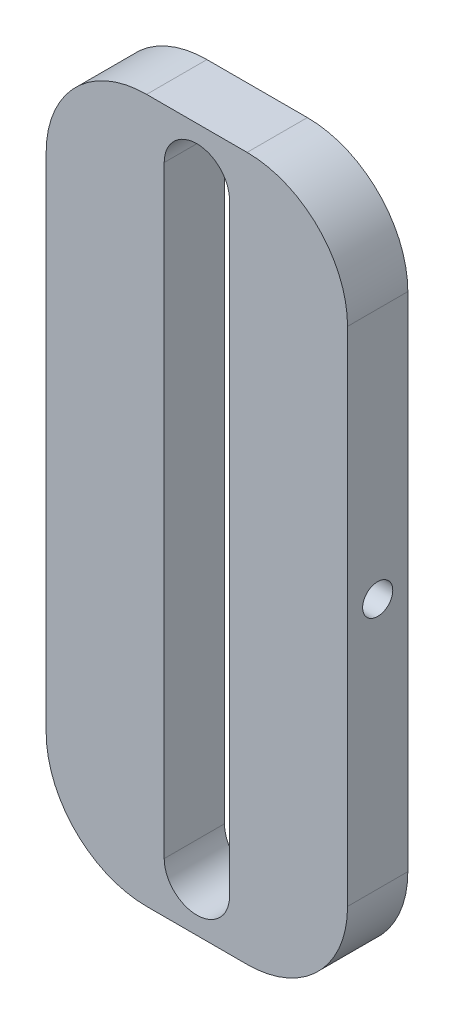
ISO-10303-21;
HEADER;
FILE_DESCRIPTION(('STEP AP214'),'2;1');
FILE_NAME('part.step','',(''),(''),'','','');
FILE_SCHEMA(('AUTOMOTIVE_DESIGN { 1 0 10303 214 1 1 1 1 }'));
ENDSEC;
DATA;
#1=APPLICATION_CONTEXT('core data for automotive mechanical design processes');
#2=APPLICATION_PROTOCOL_DEFINITION('international standard','automotive_design',2000,#1);
#3=PRODUCT_CONTEXT('',#1,'mechanical');
#4=PRODUCT('Part','Part','',(#3));
#5=PRODUCT_RELATED_PRODUCT_CATEGORY('part','',(#4));
#6=PRODUCT_DEFINITION_FORMATION('','',#4);
#7=PRODUCT_DEFINITION_CONTEXT('part definition',#1,'design');
#8=PRODUCT_DEFINITION('design','',#6,#7);
#9=PRODUCT_DEFINITION_SHAPE('','',#8);
#10=(LENGTH_UNIT() NAMED_UNIT(*) SI_UNIT(.MILLI.,.METRE.));
#11=(NAMED_UNIT(*) PLANE_ANGLE_UNIT() SI_UNIT($,.RADIAN.));
#12=(NAMED_UNIT(*) SI_UNIT($,.STERADIAN.) SOLID_ANGLE_UNIT());
#13=UNCERTAINTY_MEASURE_WITH_UNIT(LENGTH_MEASURE(1.E-05),#10,'distance_accuracy_value','');
#14=(GEOMETRIC_REPRESENTATION_CONTEXT(3) GLOBAL_UNCERTAINTY_ASSIGNED_CONTEXT((#13)) GLOBAL_UNIT_ASSIGNED_CONTEXT((#10,
#11,#12)) REPRESENTATION_CONTEXT('',''));
#15=CARTESIAN_POINT('',(0.,0.,0.));
#16=DIRECTION('',(0.,0.,1.));
#17=DIRECTION('',(1.,0.,0.));
#18=AXIS2_PLACEMENT_3D('',#15,#16,#17);
#19=CARTESIAN_POINT('',(0.,0.,6.));
#20=DIRECTION('',(1.,0.,0.));
#21=DIRECTION('',(0.,1.,0.));
#22=AXIS2_PLACEMENT_3D('',#19,#20,#21);
#23=PLANE('',#22);
#24=DIRECTION('',(0.,-1.,0.));
#25=VECTOR('',#24,1.);
#26=CARTESIAN_POINT('',(0.,0.,0.));
#27=LINE('',#26,#25);
#28=CARTESIAN_POINT('',(0.,60.,0.));
#29=VERTEX_POINT('',#28);
#30=CARTESIAN_POINT('',(0.,10.,0.));
#31=VERTEX_POINT('',#30);
#32=EDGE_CURVE('E142',#29,#31,#27,.T.);
#33=ORIENTED_EDGE('',*,*,#32,.T.);
#34=DIRECTION('',(0.,0.,-1.));
#35=VECTOR('',#34,1.);
#36=CARTESIAN_POINT('',(0.,10.,6.));
#37=LINE('',#36,#35);
#38=CARTESIAN_POINT('',(0.,10.,6.));
#39=VERTEX_POINT('',#38);
#40=EDGE_CURVE('E204',#31,#39,#37,.F.);
#41=ORIENTED_EDGE('',*,*,#40,.T.);
#42=DIRECTION('',(0.,-1.,0.));
#43=VECTOR('',#42,1.);
#44=CARTESIAN_POINT('',(0.,0.,6.));
#45=LINE('',#44,#43);
#46=CARTESIAN_POINT('',(0.,60.,6.));
#47=VERTEX_POINT('',#46);
#48=EDGE_CURVE('E168',#47,#39,#45,.T.);
#49=ORIENTED_EDGE('',*,*,#48,.F.);
#50=DIRECTION('',(0.,0.,-1.));
#51=VECTOR('',#50,1.);
#52=CARTESIAN_POINT('',(0.,60.,6.));
#53=LINE('',#52,#51);
#54=EDGE_CURVE('E201',#47,#29,#53,.T.);
#55=ORIENTED_EDGE('',*,*,#54,.T.);
#56=EDGE_LOOP('',(#33,#41,#49,#55));
#57=FACE_BOUND('',#56,.T.);
#58=CARTESIAN_POINT('',(0.,35.,3.));
#59=DIRECTION('',(1.,0.,0.));
#60=DIRECTION('',(0.,0.,-1.));
#61=AXIS2_PLACEMENT_3D('',#58,#59,#60);
#62=CIRCLE('',#61,1.5);
#63=CARTESIAN_POINT('',(0.,35.,1.5));
#64=VERTEX_POINT('',#63);
#65=EDGE_CURVE('E308',#64,#64,#62,.T.);
#66=ORIENTED_EDGE('',*,*,#65,.T.);
#67=EDGE_LOOP('',(#66));
#68=FACE_BOUND('',#67,.T.);
#69=ADVANCED_FACE('F33',(#57,#68),#23,.F.);
#70=CARTESIAN_POINT('',(0.,70.,6.));
#71=DIRECTION('',(0.,0.,-1.));
#72=DIRECTION('',(-1.,0.,0.));
#73=AXIS2_PLACEMENT_3D('',#70,#71,#72);
#74=PLANE('',#73);
#75=ORIENTED_EDGE('',*,*,#48,.T.);
#76=CARTESIAN_POINT('',(10.,10.,6.));
#77=DIRECTION('',(0.,0.,-1.));
#78=DIRECTION('',(-1.,0.,0.));
#79=AXIS2_PLACEMENT_3D('',#76,#77,#78);
#80=CIRCLE('',#79,10.);
#81=CARTESIAN_POINT('',(10.,0.,6.));
#82=VERTEX_POINT('',#81);
#83=EDGE_CURVE('E211',#39,#82,#80,.F.);
#84=ORIENTED_EDGE('',*,*,#83,.T.);
#85=DIRECTION('',(1.,0.,0.));
#86=VECTOR('',#85,1.);
#87=CARTESIAN_POINT('',(0.,0.,6.));
#88=LINE('',#87,#86);
#89=CARTESIAN_POINT('',(20.,0.,6.));
#90=VERTEX_POINT('',#89);
#91=EDGE_CURVE('E171',#82,#90,#88,.T.);
#92=ORIENTED_EDGE('',*,*,#91,.T.);
#93=CARTESIAN_POINT('',(20.,10.,6.));
#94=DIRECTION('',(0.,0.,-1.));
#95=DIRECTION('',(-1.,0.,0.));
#96=AXIS2_PLACEMENT_3D('',#93,#94,#95);
#97=CIRCLE('',#96,10.);
#98=CARTESIAN_POINT('',(30.,10.,6.));
#99=VERTEX_POINT('',#98);
#100=EDGE_CURVE('E209',#90,#99,#97,.F.);
#101=ORIENTED_EDGE('',*,*,#100,.T.);
#102=DIRECTION('',(0.,1.,0.));
#103=VECTOR('',#102,1.);
#104=CARTESIAN_POINT('',(30.,0.,6.));
#105=LINE('',#104,#103);
#106=CARTESIAN_POINT('',(30.,60.,6.));
#107=VERTEX_POINT('',#106);
#108=EDGE_CURVE('E175',#99,#107,#105,.T.);
#109=ORIENTED_EDGE('',*,*,#108,.T.);
#110=CARTESIAN_POINT('',(20.,60.,6.));
#111=DIRECTION('',(0.,0.,-1.));
#112=DIRECTION('',(-1.,0.,0.));
#113=AXIS2_PLACEMENT_3D('',#110,#111,#112);
#114=CIRCLE('',#113,10.);
#115=CARTESIAN_POINT('',(20.,70.,6.));
#116=VERTEX_POINT('',#115);
#117=EDGE_CURVE('E54',#107,#116,#114,.F.);
#118=ORIENTED_EDGE('',*,*,#117,.T.);
#119=DIRECTION('',(-1.,0.,0.));
#120=VECTOR('',#119,1.);
#121=CARTESIAN_POINT('',(0.,70.,6.));
#122=LINE('',#121,#120);
#123=CARTESIAN_POINT('',(9.99999999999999,70.,6.));
#124=VERTEX_POINT('',#123);
#125=EDGE_CURVE('E177',#116,#124,#122,.T.);
#126=ORIENTED_EDGE('',*,*,#125,.T.);
#127=CARTESIAN_POINT('',(9.99999999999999,60.,6.));
#128=DIRECTION('',(0.,0.,-1.));
#129=DIRECTION('',(-1.,0.,0.));
#130=AXIS2_PLACEMENT_3D('',#127,#128,#129);
#131=CIRCLE('',#130,10.);
#132=EDGE_CURVE('E206',#124,#47,#131,.F.);
#133=ORIENTED_EDGE('',*,*,#132,.T.);
#134=EDGE_LOOP('',(#75,#84,#92,#101,#109,#118,#126,#133));
#135=FACE_BOUND('',#134,.T.);
#136=CARTESIAN_POINT('',(15.,65.,6.));
#137=DIRECTION('',(0.,0.,1.));
#138=DIRECTION('',(-1.,0.,0.));
#139=AXIS2_PLACEMENT_3D('',#136,#137,#138);
#140=CIRCLE('',#139,3.25);
#141=CARTESIAN_POINT('',(18.25,65.,6.));
#142=VERTEX_POINT('',#141);
#143=CARTESIAN_POINT('',(11.75,65.,6.));
#144=VERTEX_POINT('',#143);
#145=EDGE_CURVE('E124',#142,#144,#140,.T.);
#146=ORIENTED_EDGE('',*,*,#145,.F.);
#147=DIRECTION('',(0.,1.,0.));
#148=VECTOR('',#147,1.);
#149=CARTESIAN_POINT('',(18.25,5.,6.));
#150=LINE('',#149,#148);
#151=CARTESIAN_POINT('',(18.25,5.,6.));
#152=VERTEX_POINT('',#151);
#153=EDGE_CURVE('E150',#152,#142,#150,.T.);
#154=ORIENTED_EDGE('',*,*,#153,.F.);
#155=CARTESIAN_POINT('',(15.,5.,6.));
#156=DIRECTION('',(0.,0.,1.));
#157=DIRECTION('',(1.,0.,0.));
#158=AXIS2_PLACEMENT_3D('',#155,#156,#157);
#159=CIRCLE('',#158,3.25);
#160=CARTESIAN_POINT('',(11.75,5.,6.));
#161=VERTEX_POINT('',#160);
#162=EDGE_CURVE('E148',#161,#152,#159,.T.);
#163=ORIENTED_EDGE('',*,*,#162,.F.);
#164=DIRECTION('',(0.,-1.,0.));
#165=VECTOR('',#164,1.);
#166=CARTESIAN_POINT('',(11.75,5.,6.));
#167=LINE('',#166,#165);
#168=EDGE_CURVE('E134',#144,#161,#167,.T.);
#169=ORIENTED_EDGE('',*,*,#168,.F.);
#170=EDGE_LOOP('',(#146,#154,#163,#169));
#171=FACE_BOUND('',#170,.T.);
#172=ADVANCED_FACE('F146',(#135,#171),#74,.F.);
#173=CARTESIAN_POINT('',(0.,70.,0.));
#174=DIRECTION('',(0.,0.,-1.));
#175=DIRECTION('',(-1.,0.,0.));
#176=AXIS2_PLACEMENT_3D('',#173,#174,#175);
#177=PLANE('',#176);
#178=DIRECTION('',(1.,0.,0.));
#179=VECTOR('',#178,1.);
#180=CARTESIAN_POINT('',(0.,0.,0.));
#181=LINE('',#180,#179);
#182=CARTESIAN_POINT('',(10.,0.,0.));
#183=VERTEX_POINT('',#182);
#184=CARTESIAN_POINT('',(20.,0.,0.));
#185=VERTEX_POINT('',#184);
#186=EDGE_CURVE('E182',#183,#185,#181,.T.);
#187=ORIENTED_EDGE('',*,*,#186,.F.);
#188=CARTESIAN_POINT('',(10.,10.,0.));
#189=DIRECTION('',(0.,0.,-1.));
#190=DIRECTION('',(-1.,0.,0.));
#191=AXIS2_PLACEMENT_3D('',#188,#189,#190);
#192=CIRCLE('',#191,10.);
#193=EDGE_CURVE('E199',#183,#31,#192,.T.);
#194=ORIENTED_EDGE('',*,*,#193,.T.);
#195=ORIENTED_EDGE('',*,*,#32,.F.);
#196=CARTESIAN_POINT('',(9.99999999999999,60.,0.));
#197=DIRECTION('',(0.,0.,-1.));
#198=DIRECTION('',(-1.,0.,0.));
#199=AXIS2_PLACEMENT_3D('',#196,#197,#198);
#200=CIRCLE('',#199,10.);
#201=CARTESIAN_POINT('',(9.99999999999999,70.,0.));
#202=VERTEX_POINT('',#201);
#203=EDGE_CURVE('E193',#29,#202,#200,.T.);
#204=ORIENTED_EDGE('',*,*,#203,.T.);
#205=DIRECTION('',(-1.,0.,0.));
#206=VECTOR('',#205,1.);
#207=CARTESIAN_POINT('',(0.,70.,0.));
#208=LINE('',#207,#206);
#209=CARTESIAN_POINT('',(20.,70.,0.));
#210=VERTEX_POINT('',#209);
#211=EDGE_CURVE('E172',#210,#202,#208,.T.);
#212=ORIENTED_EDGE('',*,*,#211,.F.);
#213=CARTESIAN_POINT('',(20.,60.,0.));
#214=DIRECTION('',(0.,0.,-1.));
#215=DIRECTION('',(-1.,0.,0.));
#216=AXIS2_PLACEMENT_3D('',#213,#214,#215);
#217=CIRCLE('',#216,10.);
#218=CARTESIAN_POINT('',(30.,60.,0.));
#219=VERTEX_POINT('',#218);
#220=EDGE_CURVE('E195',#210,#219,#217,.T.);
#221=ORIENTED_EDGE('',*,*,#220,.T.);
#222=DIRECTION('',(0.,1.,0.));
#223=VECTOR('',#222,1.);
#224=CARTESIAN_POINT('',(30.,0.,0.));
#225=LINE('',#224,#223);
#226=CARTESIAN_POINT('',(30.,10.,0.));
#227=VERTEX_POINT('',#226);
#228=EDGE_CURVE('E185',#227,#219,#225,.T.);
#229=ORIENTED_EDGE('',*,*,#228,.F.);
#230=CARTESIAN_POINT('',(20.,10.,0.));
#231=DIRECTION('',(0.,0.,-1.));
#232=DIRECTION('',(-1.,0.,0.));
#233=AXIS2_PLACEMENT_3D('',#230,#231,#232);
#234=CIRCLE('',#233,10.);
#235=EDGE_CURVE('E197',#227,#185,#234,.T.);
#236=ORIENTED_EDGE('',*,*,#235,.T.);
#237=EDGE_LOOP('',(#187,#194,#195,#204,#212,#221,#229,#236));
#238=FACE_BOUND('',#237,.T.);
#239=DIRECTION('',(0.,1.,0.));
#240=VECTOR('',#239,1.);
#241=CARTESIAN_POINT('',(18.25,5.,0.));
#242=LINE('',#241,#240);
#243=CARTESIAN_POINT('',(18.25,5.,0.));
#244=VERTEX_POINT('',#243);
#245=CARTESIAN_POINT('',(18.25,65.,0.));
#246=VERTEX_POINT('',#245);
#247=EDGE_CURVE('E135',#244,#246,#242,.T.);
#248=ORIENTED_EDGE('',*,*,#247,.T.);
#249=CARTESIAN_POINT('',(15.,65.,0.));
#250=DIRECTION('',(0.,0.,1.));
#251=DIRECTION('',(-1.,0.,0.));
#252=AXIS2_PLACEMENT_3D('',#249,#250,#251);
#253=CIRCLE('',#252,3.25);
#254=CARTESIAN_POINT('',(11.75,65.,0.));
#255=VERTEX_POINT('',#254);
#256=EDGE_CURVE('E155',#246,#255,#253,.T.);
#257=ORIENTED_EDGE('',*,*,#256,.T.);
#258=DIRECTION('',(0.,-1.,0.));
#259=VECTOR('',#258,1.);
#260=CARTESIAN_POINT('',(11.75,5.,0.));
#261=LINE('',#260,#259);
#262=CARTESIAN_POINT('',(11.75,5.,0.));
#263=VERTEX_POINT('',#262);
#264=EDGE_CURVE('E141',#255,#263,#261,.T.);
#265=ORIENTED_EDGE('',*,*,#264,.T.);
#266=CARTESIAN_POINT('',(15.,5.,0.));
#267=DIRECTION('',(0.,0.,1.));
#268=DIRECTION('',(1.,0.,0.));
#269=AXIS2_PLACEMENT_3D('',#266,#267,#268);
#270=CIRCLE('',#269,3.25);
#271=EDGE_CURVE('E159',#263,#244,#270,.T.);
#272=ORIENTED_EDGE('',*,*,#271,.T.);
#273=EDGE_LOOP('',(#248,#257,#265,#272));
#274=FACE_BOUND('',#273,.T.);
#275=ADVANCED_FACE('F227',(#238,#274),#177,.T.);
#276=CARTESIAN_POINT('',(0.,0.,6.));
#277=DIRECTION('',(0.,1.,0.));
#278=DIRECTION('',(-1.,0.,0.));
#279=AXIS2_PLACEMENT_3D('',#276,#277,#278);
#280=PLANE('',#279);
#281=ORIENTED_EDGE('',*,*,#91,.F.);
#282=DIRECTION('',(0.,0.,-1.));
#283=VECTOR('',#282,1.);
#284=CARTESIAN_POINT('',(10.,0.,6.));
#285=LINE('',#284,#283);
#286=EDGE_CURVE('E190',#82,#183,#285,.T.);
#287=ORIENTED_EDGE('',*,*,#286,.T.);
#288=ORIENTED_EDGE('',*,*,#186,.T.);
#289=DIRECTION('',(0.,0.,-1.));
#290=VECTOR('',#289,1.);
#291=CARTESIAN_POINT('',(20.,0.,6.));
#292=LINE('',#291,#290);
#293=EDGE_CURVE('E179',#185,#90,#292,.F.);
#294=ORIENTED_EDGE('',*,*,#293,.T.);
#295=EDGE_LOOP('',(#281,#287,#288,#294));
#296=FACE_BOUND('',#295,.T.);
#297=ADVANCED_FACE('F248',(#296),#280,.F.);
#298=CARTESIAN_POINT('',(30.,0.,6.));
#299=DIRECTION('',(-1.,0.,0.));
#300=DIRECTION('',(0.,0.,1.));
#301=AXIS2_PLACEMENT_3D('',#298,#299,#300);
#302=PLANE('',#301);
#303=CARTESIAN_POINT('',(30.,35.,3.));
#304=DIRECTION('',(1.,0.,0.));
#305=DIRECTION('',(0.,0.,-1.));
#306=AXIS2_PLACEMENT_3D('',#303,#304,#305);
#307=CIRCLE('',#306,1.5);
#308=CARTESIAN_POINT('',(30.,35.,1.5));
#309=VERTEX_POINT('',#308);
#310=EDGE_CURVE('E307',#309,#309,#307,.T.);
#311=ORIENTED_EDGE('',*,*,#310,.F.);
#312=EDGE_LOOP('',(#311));
#313=FACE_BOUND('',#312,.T.);
#314=ORIENTED_EDGE('',*,*,#108,.F.);
#315=DIRECTION('',(0.,0.,-1.));
#316=VECTOR('',#315,1.);
#317=CARTESIAN_POINT('',(30.,10.,6.));
#318=LINE('',#317,#316);
#319=EDGE_CURVE('E215',#99,#227,#318,.T.);
#320=ORIENTED_EDGE('',*,*,#319,.T.);
#321=ORIENTED_EDGE('',*,*,#228,.T.);
#322=DIRECTION('',(0.,0.,-1.));
#323=VECTOR('',#322,1.);
#324=CARTESIAN_POINT('',(30.,60.,6.));
#325=LINE('',#324,#323);
#326=EDGE_CURVE('E213',#219,#107,#325,.F.);
#327=ORIENTED_EDGE('',*,*,#326,.T.);
#328=EDGE_LOOP('',(#314,#320,#321,#327));
#329=FACE_BOUND('',#328,.T.);
#330=ADVANCED_FACE('F221',(#313,#329),#302,.F.);
#331=CARTESIAN_POINT('',(0.,70.,6.));
#332=DIRECTION('',(0.,-1.,0.));
#333=DIRECTION('',(0.,0.,-1.));
#334=AXIS2_PLACEMENT_3D('',#331,#332,#333);
#335=PLANE('',#334);
#336=ORIENTED_EDGE('',*,*,#125,.F.);
#337=DIRECTION('',(0.,0.,-1.));
#338=VECTOR('',#337,1.);
#339=CARTESIAN_POINT('',(20.,70.,6.));
#340=LINE('',#339,#338);
#341=EDGE_CURVE('E11',#116,#210,#340,.T.);
#342=ORIENTED_EDGE('',*,*,#341,.T.);
#343=ORIENTED_EDGE('',*,*,#211,.T.);
#344=DIRECTION('',(0.,0.,-1.));
#345=VECTOR('',#344,1.);
#346=CARTESIAN_POINT('',(9.99999999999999,70.,6.));
#347=LINE('',#346,#345);
#348=EDGE_CURVE('E41',#202,#124,#347,.F.);
#349=ORIENTED_EDGE('',*,*,#348,.T.);
#350=EDGE_LOOP('',(#336,#342,#343,#349));
#351=FACE_BOUND('',#350,.T.);
#352=ADVANCED_FACE('F233',(#351),#335,.F.);
#353=CARTESIAN_POINT('',(15.,65.,6.));
#354=DIRECTION('',(0.,0.,-1.));
#355=DIRECTION('',(-1.,0.,0.));
#356=AXIS2_PLACEMENT_3D('',#353,#354,#355);
#357=CYLINDRICAL_SURFACE('',#356,3.25);
#358=ORIENTED_EDGE('',*,*,#256,.F.);
#359=DIRECTION('',(0.,0.,-1.));
#360=VECTOR('',#359,1.);
#361=CARTESIAN_POINT('',(18.25,65.,6.));
#362=LINE('',#361,#360);
#363=EDGE_CURVE('E130',#142,#246,#362,.T.);
#364=ORIENTED_EDGE('',*,*,#363,.F.);
#365=ORIENTED_EDGE('',*,*,#145,.T.);
#366=DIRECTION('',(0.,0.,-1.));
#367=VECTOR('',#366,1.);
#368=CARTESIAN_POINT('',(11.75,65.,6.));
#369=LINE('',#368,#367);
#370=EDGE_CURVE('E127',#144,#255,#369,.T.);
#371=ORIENTED_EDGE('',*,*,#370,.T.);
#372=EDGE_LOOP('',(#358,#364,#365,#371));
#373=FACE_BOUND('',#372,.T.);
#374=ADVANCED_FACE('F126',(#373),#357,.F.);
#375=CARTESIAN_POINT('',(11.75,5.,6.));
#376=DIRECTION('',(1.,0.,0.));
#377=DIRECTION('',(0.,0.,-1.));
#378=AXIS2_PLACEMENT_3D('',#375,#376,#377);
#379=PLANE('',#378);
#380=ORIENTED_EDGE('',*,*,#264,.F.);
#381=ORIENTED_EDGE('',*,*,#370,.F.);
#382=ORIENTED_EDGE('',*,*,#168,.T.);
#383=DIRECTION('',(0.,0.,-1.));
#384=VECTOR('',#383,1.);
#385=CARTESIAN_POINT('',(11.75,5.,6.));
#386=LINE('',#385,#384);
#387=EDGE_CURVE('E143',#161,#263,#386,.T.);
#388=ORIENTED_EDGE('',*,*,#387,.T.);
#389=EDGE_LOOP('',(#380,#381,#382,#388));
#390=FACE_BOUND('',#389,.T.);
#391=ADVANCED_FACE('F138',(#390),#379,.T.);
#392=CARTESIAN_POINT('',(15.,5.,6.));
#393=DIRECTION('',(0.,0.,-1.));
#394=DIRECTION('',(-1.,0.,0.));
#395=AXIS2_PLACEMENT_3D('',#392,#393,#394);
#396=CYLINDRICAL_SURFACE('',#395,3.25);
#397=ORIENTED_EDGE('',*,*,#271,.F.);
#398=ORIENTED_EDGE('',*,*,#387,.F.);
#399=ORIENTED_EDGE('',*,*,#162,.T.);
#400=DIRECTION('',(0.,0.,-1.));
#401=VECTOR('',#400,1.);
#402=CARTESIAN_POINT('',(18.25,5.,6.));
#403=LINE('',#402,#401);
#404=EDGE_CURVE('E165',#152,#244,#403,.T.);
#405=ORIENTED_EDGE('',*,*,#404,.T.);
#406=EDGE_LOOP('',(#397,#398,#399,#405));
#407=FACE_BOUND('',#406,.T.);
#408=ADVANCED_FACE('F280',(#407),#396,.F.);
#409=CARTESIAN_POINT('',(18.25,5.,6.));
#410=DIRECTION('',(-1.,0.,0.));
#411=DIRECTION('',(0.,0.,1.));
#412=AXIS2_PLACEMENT_3D('',#409,#410,#411);
#413=PLANE('',#412);
#414=ORIENTED_EDGE('',*,*,#247,.F.);
#415=ORIENTED_EDGE('',*,*,#404,.F.);
#416=ORIENTED_EDGE('',*,*,#153,.T.);
#417=ORIENTED_EDGE('',*,*,#363,.T.);
#418=EDGE_LOOP('',(#414,#415,#416,#417));
#419=FACE_BOUND('',#418,.T.);
#420=ADVANCED_FACE('F283',(#419),#413,.T.);
#421=CARTESIAN_POINT('',(20.,35.,3.));
#422=DIRECTION('',(1.,0.,0.));
#423=DIRECTION('',(0.,0.,-1.));
#424=AXIS2_PLACEMENT_3D('',#421,#422,#423);
#425=CYLINDRICAL_SURFACE('',#424,1.5);
#426=CARTESIAN_POINT('',(20.,35.,3.));
#427=DIRECTION('',(1.,0.,0.));
#428=DIRECTION('',(0.,0.,-1.));
#429=AXIS2_PLACEMENT_3D('',#426,#427,#428);
#430=CIRCLE('',#429,1.5);
#431=CARTESIAN_POINT('',(20.,35.,1.5));
#432=VERTEX_POINT('',#431);
#433=EDGE_CURVE('E157',#432,#432,#430,.T.);
#434=ORIENTED_EDGE('',*,*,#433,.F.);
#435=EDGE_LOOP('',(#434));
#436=FACE_BOUND('',#435,.T.);
#437=ORIENTED_EDGE('',*,*,#310,.T.);
#438=EDGE_LOOP('',(#437));
#439=FACE_BOUND('',#438,.T.);
#440=ADVANCED_FACE('F287',(#436,#439),#425,.F.);
#441=CARTESIAN_POINT('',(20.,35.,3.));
#442=DIRECTION('',(1.,0.,0.));
#443=DIRECTION('',(0.,0.,-1.));
#444=AXIS2_PLACEMENT_3D('',#441,#442,#443);
#445=PLANE('',#444);
#446=ORIENTED_EDGE('',*,*,#433,.T.);
#447=EDGE_LOOP('',(#446));
#448=FACE_BOUND('',#447,.T.);
#449=ADVANCED_FACE('F291',(#448),#445,.T.);
#450=CARTESIAN_POINT('',(10.,35.,3.));
#451=DIRECTION('',(-1.,0.,0.));
#452=DIRECTION('',(0.,0.,1.));
#453=AXIS2_PLACEMENT_3D('',#450,#451,#452);
#454=CYLINDRICAL_SURFACE('',#453,1.5);
#455=CARTESIAN_POINT('',(10.,35.,3.));
#456=DIRECTION('',(1.,0.,0.));
#457=DIRECTION('',(0.,0.,-1.));
#458=AXIS2_PLACEMENT_3D('',#455,#456,#457);
#459=CIRCLE('',#458,1.5);
#460=CARTESIAN_POINT('',(10.,35.,1.5));
#461=VERTEX_POINT('',#460);
#462=EDGE_CURVE('E306',#461,#461,#459,.T.);
#463=ORIENTED_EDGE('',*,*,#462,.T.);
#464=EDGE_LOOP('',(#463));
#465=FACE_BOUND('',#464,.T.);
#466=ORIENTED_EDGE('',*,*,#65,.F.);
#467=EDGE_LOOP('',(#466));
#468=FACE_BOUND('',#467,.T.);
#469=ADVANCED_FACE('F295',(#465,#468),#454,.F.);
#470=CARTESIAN_POINT('',(10.,35.,3.));
#471=DIRECTION('',(-1.,0.,0.));
#472=DIRECTION('',(0.,0.,-1.));
#473=AXIS2_PLACEMENT_3D('',#470,#471,#472);
#474=PLANE('',#473);
#475=ORIENTED_EDGE('',*,*,#462,.F.);
#476=EDGE_LOOP('',(#475));
#477=FACE_BOUND('',#476,.T.);
#478=ADVANCED_FACE('F257',(#477),#474,.T.);
#479=CARTESIAN_POINT('',(10.,10.,6.));
#480=DIRECTION('',(0.,0.,-1.));
#481=DIRECTION('',(-1.,0.,0.));
#482=AXIS2_PLACEMENT_3D('',#479,#480,#481);
#483=CYLINDRICAL_SURFACE('',#482,10.);
#484=ORIENTED_EDGE('',*,*,#83,.F.);
#485=ORIENTED_EDGE('',*,*,#40,.F.);
#486=ORIENTED_EDGE('',*,*,#193,.F.);
#487=ORIENTED_EDGE('',*,*,#286,.F.);
#488=EDGE_LOOP('',(#484,#485,#486,#487));
#489=FACE_BOUND('',#488,.T.);
#490=ADVANCED_FACE('F245',(#489),#483,.T.);
#491=CARTESIAN_POINT('',(20.,10.,6.));
#492=DIRECTION('',(0.,0.,-1.));
#493=DIRECTION('',(-1.,0.,0.));
#494=AXIS2_PLACEMENT_3D('',#491,#492,#493);
#495=CYLINDRICAL_SURFACE('',#494,10.);
#496=ORIENTED_EDGE('',*,*,#100,.F.);
#497=ORIENTED_EDGE('',*,*,#293,.F.);
#498=ORIENTED_EDGE('',*,*,#235,.F.);
#499=ORIENTED_EDGE('',*,*,#319,.F.);
#500=EDGE_LOOP('',(#496,#497,#498,#499));
#501=FACE_BOUND('',#500,.T.);
#502=ADVANCED_FACE('F250',(#501),#495,.T.);
#503=CARTESIAN_POINT('',(20.,60.,6.));
#504=DIRECTION('',(0.,0.,-1.));
#505=DIRECTION('',(-1.,0.,0.));
#506=AXIS2_PLACEMENT_3D('',#503,#504,#505);
#507=CYLINDRICAL_SURFACE('',#506,10.);
#508=ORIENTED_EDGE('',*,*,#117,.F.);
#509=ORIENTED_EDGE('',*,*,#326,.F.);
#510=ORIENTED_EDGE('',*,*,#220,.F.);
#511=ORIENTED_EDGE('',*,*,#341,.F.);
#512=EDGE_LOOP('',(#508,#509,#510,#511));
#513=FACE_BOUND('',#512,.T.);
#514=ADVANCED_FACE('F232',(#513),#507,.T.);
#515=CARTESIAN_POINT('',(9.99999999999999,60.,6.));
#516=DIRECTION('',(0.,0.,-1.));
#517=DIRECTION('',(-1.,0.,0.));
#518=AXIS2_PLACEMENT_3D('',#515,#516,#517);
#519=CYLINDRICAL_SURFACE('',#518,10.);
#520=ORIENTED_EDGE('',*,*,#132,.F.);
#521=ORIENTED_EDGE('',*,*,#348,.F.);
#522=ORIENTED_EDGE('',*,*,#203,.F.);
#523=ORIENTED_EDGE('',*,*,#54,.F.);
#524=EDGE_LOOP('',(#520,#521,#522,#523));
#525=FACE_BOUND('',#524,.T.);
#526=ADVANCED_FACE('F35',(#525),#519,.T.);
#527=CLOSED_SHELL('',(#69,#172,#275,#297,#330,#352,#374,#391,#408,#420,#440,#449,#469,#478,#490,
#502,#514,#526));
#528=MANIFOLD_SOLID_BREP('B2',#527);
#529=ADVANCED_BREP_SHAPE_REPRESENTATION('',(#18,#528),#14);
#530=SHAPE_DEFINITION_REPRESENTATION(#9,#529);
ENDSEC;
END-ISO-10303-21;
